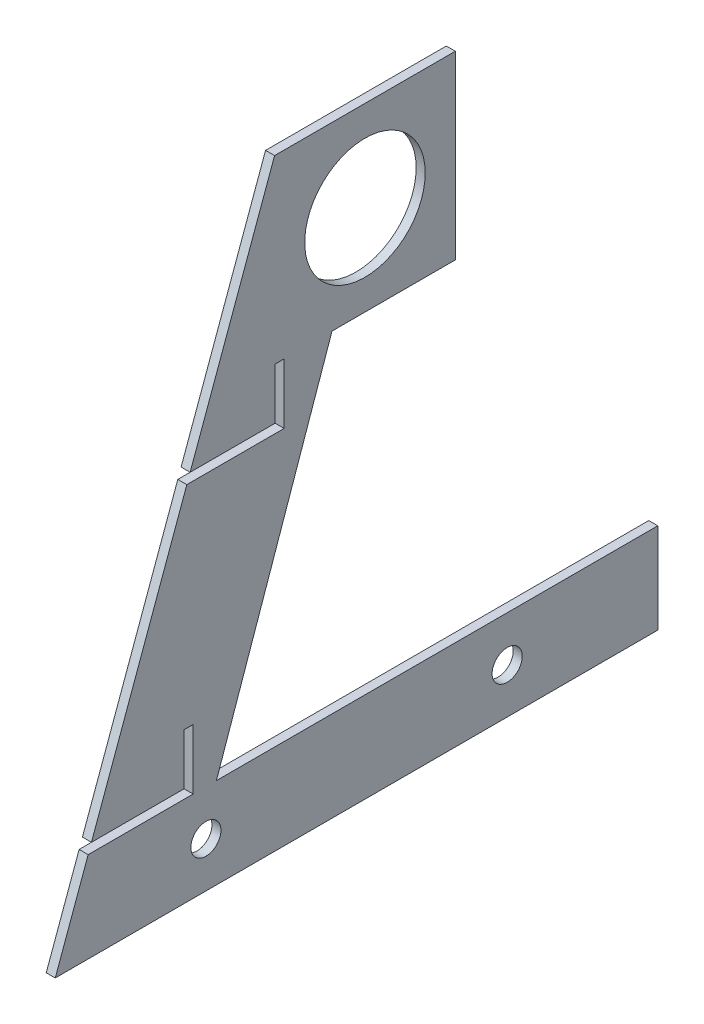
from build123d import *

# Parameters (mm, degrees)
SKETCH1_R           = 20
SKETCH1_R_2         = 5
BOSS_EXTRUDE1_DEPTH = 3


with BuildPart() as part:
    # Sketch1 → Boss-Extrude1 (new body)
    with BuildSketch(Plane(origin=(0, 0, 0), x_dir=(0, 0, -1), z_dir=(1, 0, 0))):
        Polygon((-86.983641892, -44.465988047), (-48.597122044, 65.564309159), (-7.664785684, 65.564309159), (-7.664785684, 125.564309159), (-67.664785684, 125.564309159), (-95.701521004, 48.534011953), (-67.47932004, 48.534011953), (-67.47932004, 65.534011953), (-64.47932004, 65.534011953), (-64.47932004, 45.534011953), (-96.793431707, 45.534011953), (-128.458842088, -41.465988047), (-97.692523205, -41.465988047), (-97.692523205, -24.465988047), (-94.692523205, -24.465988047), (-94.692523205, -44.465988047), (-129.550752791, -44.465988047), (-140.458832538, -74.435690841), (-140.469859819, -74.465988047), (59.541167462, -74.465988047), (59.541167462, -44.465988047), align=None)
        with Locations((-37.664785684, 95.564309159)):
            Circle(SKETCH1_R, mode=Mode.SUBTRACT)
        with Locations((9.541167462, -59.465988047)):
            Circle(SKETCH1_R_2, mode=Mode.SUBTRACT)
        with Locations((-90.458832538, -59.465988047)):
            Circle(SKETCH1_R_2, mode=Mode.SUBTRACT)
    extrude(amount=BOSS_EXTRUDE1_DEPTH)


solid = part.part
